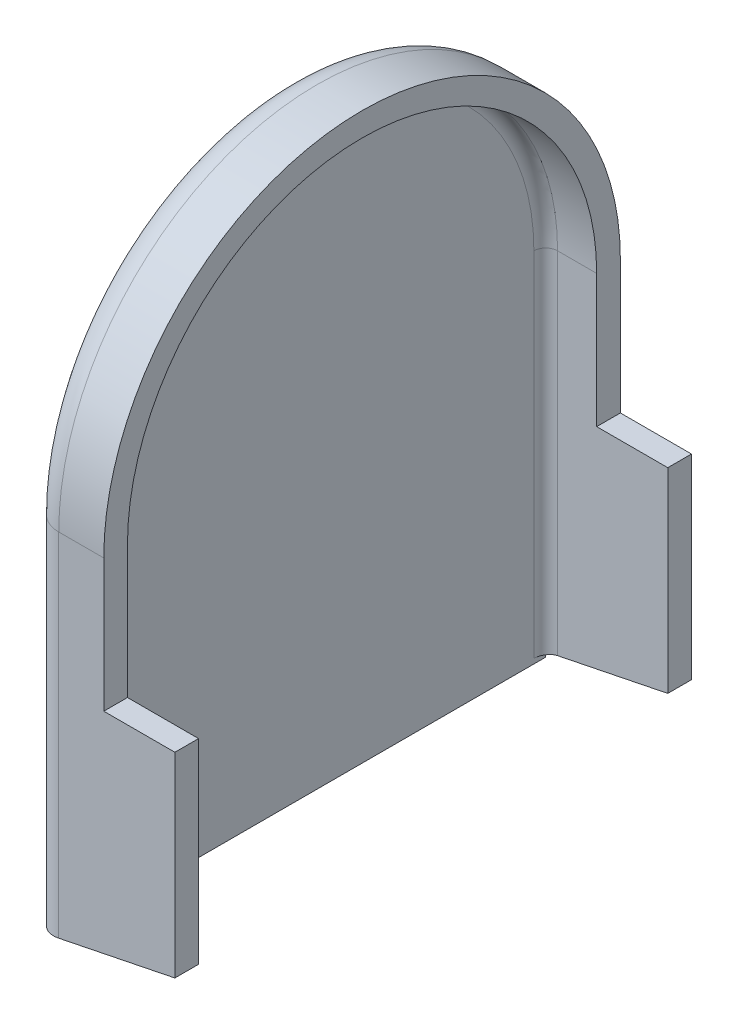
ISO-10303-21;
HEADER;
FILE_DESCRIPTION(('STEP AP214'),'2;1');
FILE_NAME('part.step','',(''),(''),'','','');
FILE_SCHEMA(('AUTOMOTIVE_DESIGN { 1 0 10303 214 1 1 1 1 }'));
ENDSEC;
DATA;
#1=APPLICATION_CONTEXT('core data for automotive mechanical design processes');
#2=APPLICATION_PROTOCOL_DEFINITION('international standard','automotive_design',2000,#1);
#3=PRODUCT_CONTEXT('',#1,'mechanical');
#4=PRODUCT('Part','Part','',(#3));
#5=PRODUCT_RELATED_PRODUCT_CATEGORY('part','',(#4));
#6=PRODUCT_DEFINITION_FORMATION('','',#4);
#7=PRODUCT_DEFINITION_CONTEXT('part definition',#1,'design');
#8=PRODUCT_DEFINITION('design','',#6,#7);
#9=PRODUCT_DEFINITION_SHAPE('','',#8);
#10=(LENGTH_UNIT() NAMED_UNIT(*) SI_UNIT(.MILLI.,.METRE.));
#11=(NAMED_UNIT(*) PLANE_ANGLE_UNIT() SI_UNIT($,.RADIAN.));
#12=(NAMED_UNIT(*) SI_UNIT($,.STERADIAN.) SOLID_ANGLE_UNIT());
#13=UNCERTAINTY_MEASURE_WITH_UNIT(LENGTH_MEASURE(1.E-05),#10,'distance_accuracy_value','');
#14=(GEOMETRIC_REPRESENTATION_CONTEXT(3) GLOBAL_UNCERTAINTY_ASSIGNED_CONTEXT((#13)) GLOBAL_UNIT_ASSIGNED_CONTEXT((#10,
#11,#12)) REPRESENTATION_CONTEXT('',''));
#15=CARTESIAN_POINT('',(0.,0.,0.));
#16=DIRECTION('',(0.,0.,1.));
#17=DIRECTION('',(1.,0.,0.));
#18=AXIS2_PLACEMENT_3D('',#15,#16,#17);
#19=CARTESIAN_POINT('',(-2.,-26.,21.8));
#20=DIRECTION('',(0.,-1.,0.));
#21=DIRECTION('',(0.,0.,-1.));
#22=AXIS2_PLACEMENT_3D('',#19,#20,#21);
#23=PLANE('',#22);
#24=DIRECTION('',(0.,0.,-1.));
#25=VECTOR('',#24,1.);
#26=CARTESIAN_POINT('',(-2.,-26.,21.8));
#27=LINE('',#26,#25);
#28=CARTESIAN_POINT('',(-2.,-26.,19.3));
#29=VERTEX_POINT('',#28);
#30=CARTESIAN_POINT('',(-2.,-26.,-19.3));
#31=VERTEX_POINT('',#30);
#32=EDGE_CURVE('E247',#29,#31,#27,.T.);
#33=ORIENTED_EDGE('',*,*,#32,.T.);
#34=CARTESIAN_POINT('',(0.5,-26.,-19.3));
#35=DIRECTION('',(0.,-1.,0.));
#36=DIRECTION('',(0.,0.,-1.));
#37=AXIS2_PLACEMENT_3D('',#34,#35,#36);
#38=CIRCLE('',#37,2.5);
#39=CARTESIAN_POINT('',(-1.94948974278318,-26.,-19.8));
#40=VERTEX_POINT('',#39);
#41=EDGE_CURVE('E433',#31,#40,#38,.T.);
#42=ORIENTED_EDGE('',*,*,#41,.T.);
#43=DIRECTION('',(1.,0.,0.));
#44=VECTOR('',#43,1.);
#45=CARTESIAN_POINT('',(10.3,-26.,-19.8));
#46=LINE('',#45,#44);
#47=CARTESIAN_POINT('',(0.,-26.,-19.8));
#48=VERTEX_POINT('',#47);
#49=EDGE_CURVE('E254',#40,#48,#46,.T.);
#50=ORIENTED_EDGE('',*,*,#49,.T.);
#51=DIRECTION('',(0.,0.,-1.));
#52=VECTOR('',#51,1.);
#53=CARTESIAN_POINT('',(0.,-26.,21.8));
#54=LINE('',#53,#52);
#55=CARTESIAN_POINT('',(0.,-26.,19.8));
#56=VERTEX_POINT('',#55);
#57=EDGE_CURVE('E304',#56,#48,#54,.T.);
#58=ORIENTED_EDGE('',*,*,#57,.F.);
#59=DIRECTION('',(1.,0.,0.));
#60=VECTOR('',#59,1.);
#61=CARTESIAN_POINT('',(10.3,-26.,19.8));
#62=LINE('',#61,#60);
#63=CARTESIAN_POINT('',(-1.94948974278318,-26.,19.8));
#64=VERTEX_POINT('',#63);
#65=EDGE_CURVE('E257',#64,#56,#62,.T.);
#66=ORIENTED_EDGE('',*,*,#65,.F.);
#67=CARTESIAN_POINT('',(0.5,-26.,19.3));
#68=DIRECTION('',(0.,-1.,0.));
#69=DIRECTION('',(0.,0.,-1.));
#70=AXIS2_PLACEMENT_3D('',#67,#68,#69);
#71=CIRCLE('',#70,2.5);
#72=EDGE_CURVE('E253',#64,#29,#71,.T.);
#73=ORIENTED_EDGE('',*,*,#72,.T.);
#74=EDGE_LOOP('',(#33,#42,#50,#58,#66,#73));
#75=FACE_BOUND('',#74,.T.);
#76=ADVANCED_FACE('F36',(#75),#23,.T.);
#77=CARTESIAN_POINT('',(-2.,-26.,-21.8));
#78=DIRECTION('',(0.,0.,-1.));
#79=DIRECTION('',(-1.,0.,0.));
#80=AXIS2_PLACEMENT_3D('',#77,#78,#79);
#81=PLANE('',#80);
#82=DIRECTION('',(-0.979963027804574,-0.199179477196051,0.));
#83=VECTOR('',#82,1.);
#84=CARTESIAN_POINT('',(-2.,-26.,-21.8));
#85=LINE('',#84,#83);
#86=CARTESIAN_POINT('',(10.3,-23.5,-21.8));
#87=VERTEX_POINT('',#86);
#88=CARTESIAN_POINT('',(0.5,-25.4918699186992,-21.8));
#89=VERTEX_POINT('',#88);
#90=EDGE_CURVE('E178',#87,#89,#85,.T.);
#91=ORIENTED_EDGE('',*,*,#90,.T.);
#92=DIRECTION('',(0.,1.,0.));
#93=VECTOR('',#92,1.);
#94=CARTESIAN_POINT('',(0.5,-26.,-21.8));
#95=LINE('',#94,#93);
#96=CARTESIAN_POINT('',(0.5,4.2,-21.8));
#97=VERTEX_POINT('',#96);
#98=EDGE_CURVE('E243',#89,#97,#95,.T.);
#99=ORIENTED_EDGE('',*,*,#98,.T.);
#100=DIRECTION('',(1.,0.,0.));
#101=VECTOR('',#100,1.);
#102=CARTESIAN_POINT('',(0.,4.2,-21.8));
#103=LINE('',#102,#101);
#104=CARTESIAN_POINT('',(4.3,4.2,-21.8));
#105=VERTEX_POINT('',#104);
#106=EDGE_CURVE('E298',#105,#97,#103,.F.);
#107=ORIENTED_EDGE('',*,*,#106,.F.);
#108=DIRECTION('',(0.,1.,0.));
#109=VECTOR('',#108,1.);
#110=CARTESIAN_POINT('',(4.3,-26.,-21.8));
#111=LINE('',#110,#109);
#112=CARTESIAN_POINT('',(4.3,-7.,-21.8));
#113=VERTEX_POINT('',#112);
#114=EDGE_CURVE('E288',#113,#105,#111,.T.);
#115=ORIENTED_EDGE('',*,*,#114,.F.);
#116=DIRECTION('',(-1.,0.,0.));
#117=VECTOR('',#116,1.);
#118=CARTESIAN_POINT('',(10.3,-7.,-21.8));
#119=LINE('',#118,#117);
#120=CARTESIAN_POINT('',(10.3,-7.,-21.8));
#121=VERTEX_POINT('',#120);
#122=EDGE_CURVE('E202',#121,#113,#119,.T.);
#123=ORIENTED_EDGE('',*,*,#122,.F.);
#124=DIRECTION('',(0.,-1.,0.));
#125=VECTOR('',#124,1.);
#126=CARTESIAN_POINT('',(10.3,-7.,-21.8));
#127=LINE('',#126,#125);
#128=EDGE_CURVE('E204',#121,#87,#127,.T.);
#129=ORIENTED_EDGE('',*,*,#128,.T.);
#130=EDGE_LOOP('',(#91,#99,#107,#115,#123,#129));
#131=FACE_BOUND('',#130,.T.);
#132=ADVANCED_FACE('F276',(#131),#81,.T.);
#133=CARTESIAN_POINT('',(4.3,-26.,-19.8));
#134=DIRECTION('',(0.,0.,-1.));
#135=DIRECTION('',(-1.,0.,0.));
#136=AXIS2_PLACEMENT_3D('',#133,#134,#135);
#137=PLANE('',#136);
#138=DIRECTION('',(-1.,0.,0.));
#139=VECTOR('',#138,1.);
#140=CARTESIAN_POINT('',(4.3,4.2,-19.8));
#141=LINE('',#140,#139);
#142=CARTESIAN_POINT('',(4.3,4.2,-19.8));
#143=VERTEX_POINT('',#142);
#144=CARTESIAN_POINT('',(1.,4.2,-19.8));
#145=VERTEX_POINT('',#144);
#146=EDGE_CURVE('E285',#143,#145,#141,.T.);
#147=ORIENTED_EDGE('',*,*,#146,.T.);
#148=DIRECTION('',(0.,-1.,0.));
#149=VECTOR('',#148,1.);
#150=CARTESIAN_POINT('',(1.,-25.5934959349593,-19.8));
#151=LINE('',#150,#149);
#152=CARTESIAN_POINT('',(1.,-25.390243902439,-19.8));
#153=VERTEX_POINT('',#152);
#154=EDGE_CURVE('E193',#145,#153,#151,.T.);
#155=ORIENTED_EDGE('',*,*,#154,.T.);
#156=DIRECTION('',(-0.979963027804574,-0.199179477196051,0.));
#157=VECTOR('',#156,1.);
#158=CARTESIAN_POINT('',(-2.,-26.,-19.8));
#159=LINE('',#158,#157);
#160=CARTESIAN_POINT('',(10.3,-23.5,-19.8));
#161=VERTEX_POINT('',#160);
#162=EDGE_CURVE('E176',#161,#153,#159,.T.);
#163=ORIENTED_EDGE('',*,*,#162,.F.);
#164=DIRECTION('',(0.,1.,0.));
#165=VECTOR('',#164,1.);
#166=CARTESIAN_POINT('',(10.3,-26.,-19.8));
#167=LINE('',#166,#165);
#168=CARTESIAN_POINT('',(10.3,-7.,-19.8));
#169=VERTEX_POINT('',#168);
#170=EDGE_CURVE('E190',#161,#169,#167,.T.);
#171=ORIENTED_EDGE('',*,*,#170,.T.);
#172=DIRECTION('',(-1.,0.,0.));
#173=VECTOR('',#172,1.);
#174=CARTESIAN_POINT('',(10.3,-7.,-19.8));
#175=LINE('',#174,#173);
#176=CARTESIAN_POINT('',(4.3,-7.,-19.8));
#177=VERTEX_POINT('',#176);
#178=EDGE_CURVE('E200',#169,#177,#175,.T.);
#179=ORIENTED_EDGE('',*,*,#178,.T.);
#180=DIRECTION('',(0.,-1.,0.));
#181=VECTOR('',#180,1.);
#182=CARTESIAN_POINT('',(4.3,-26.,-19.8));
#183=LINE('',#182,#181);
#184=EDGE_CURVE('E283',#143,#177,#183,.T.);
#185=ORIENTED_EDGE('',*,*,#184,.F.);
#186=EDGE_LOOP('',(#147,#155,#163,#171,#179,#185));
#187=FACE_BOUND('',#186,.T.);
#188=ADVANCED_FACE('F188',(#187),#137,.F.);
#189=CARTESIAN_POINT('',(10.3,0.,0.));
#190=DIRECTION('',(1.,0.,0.));
#191=DIRECTION('',(0.,0.,1.));
#192=AXIS2_PLACEMENT_3D('',#189,#190,#191);
#193=PLANE('',#192);
#194=ORIENTED_EDGE('',*,*,#170,.F.);
#195=DIRECTION('',(0.,0.,-1.));
#196=VECTOR('',#195,1.);
#197=CARTESIAN_POINT('',(10.3,-23.5,-19.8));
#198=LINE('',#197,#196);
#199=EDGE_CURVE('E173',#161,#87,#198,.T.);
#200=ORIENTED_EDGE('',*,*,#199,.T.);
#201=ORIENTED_EDGE('',*,*,#128,.F.);
#202=DIRECTION('',(0.,0.,-1.));
#203=VECTOR('',#202,1.);
#204=CARTESIAN_POINT('',(10.3,-7.,-19.8));
#205=LINE('',#204,#203);
#206=EDGE_CURVE('E199',#169,#121,#205,.T.);
#207=ORIENTED_EDGE('',*,*,#206,.F.);
#208=EDGE_LOOP('',(#194,#200,#201,#207));
#209=FACE_BOUND('',#208,.T.);
#210=ADVANCED_FACE('F197',(#209),#193,.T.);
#211=CARTESIAN_POINT('',(0.,0.,0.));
#212=DIRECTION('',(-1.,0.,0.));
#213=DIRECTION('',(0.,0.,1.));
#214=AXIS2_PLACEMENT_3D('',#211,#212,#213);
#215=PLANE('',#214);
#216=DIRECTION('',(0.,-1.,0.));
#217=VECTOR('',#216,1.);
#218=CARTESIAN_POINT('',(0.,0.,-19.8));
#219=LINE('',#218,#217);
#220=CARTESIAN_POINT('',(0.,-25.5934959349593,-19.8));
#221=VERTEX_POINT('',#220);
#222=EDGE_CURVE('E183',#221,#48,#219,.T.);
#223=ORIENTED_EDGE('',*,*,#222,.F.);
#224=DIRECTION('',(0.,0.,1.));
#225=VECTOR('',#224,1.);
#226=CARTESIAN_POINT('',(0.,-25.5934959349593,0.));
#227=LINE('',#226,#225);
#228=CARTESIAN_POINT('',(0.,-25.5934959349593,-18.8));
#229=VERTEX_POINT('',#228);
#230=EDGE_CURVE('E53',#221,#229,#227,.T.);
#231=ORIENTED_EDGE('',*,*,#230,.T.);
#232=DIRECTION('',(0.,-1.,0.));
#233=VECTOR('',#232,1.);
#234=CARTESIAN_POINT('',(0.,4.2,-18.8));
#235=LINE('',#234,#233);
#236=CARTESIAN_POINT('',(0.,4.2,-18.8));
#237=VERTEX_POINT('',#236);
#238=EDGE_CURVE('E353',#229,#237,#235,.F.);
#239=ORIENTED_EDGE('',*,*,#238,.T.);
#240=CARTESIAN_POINT('',(0.,4.2,0.));
#241=DIRECTION('',(-1.,0.,0.));
#242=DIRECTION('',(0.,0.,1.));
#243=AXIS2_PLACEMENT_3D('',#240,#241,#242);
#244=CIRCLE('',#243,18.8);
#245=CARTESIAN_POINT('',(0.,4.2,18.8));
#246=VERTEX_POINT('',#245);
#247=EDGE_CURVE('E379',#237,#246,#244,.F.);
#248=ORIENTED_EDGE('',*,*,#247,.T.);
#249=DIRECTION('',(0.,1.,0.));
#250=VECTOR('',#249,1.);
#251=CARTESIAN_POINT('',(0.,-25.5934959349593,18.8));
#252=LINE('',#251,#250);
#253=CARTESIAN_POINT('',(0.,-25.5934959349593,18.8));
#254=VERTEX_POINT('',#253);
#255=EDGE_CURVE('E376',#246,#254,#252,.F.);
#256=ORIENTED_EDGE('',*,*,#255,.T.);
#257=DIRECTION('',(0.,0.,1.));
#258=VECTOR('',#257,1.);
#259=CARTESIAN_POINT('',(0.,-25.5934959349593,19.8));
#260=LINE('',#259,#258);
#261=CARTESIAN_POINT('',(0.,-25.5934959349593,19.8));
#262=VERTEX_POINT('',#261);
#263=EDGE_CURVE('E374',#254,#262,#260,.T.);
#264=ORIENTED_EDGE('',*,*,#263,.T.);
#265=DIRECTION('',(0.,1.,0.));
#266=VECTOR('',#265,1.);
#267=CARTESIAN_POINT('',(0.,4.2,19.8));
#268=LINE('',#267,#266);
#269=EDGE_CURVE('E240',#56,#262,#268,.T.);
#270=ORIENTED_EDGE('',*,*,#269,.F.);
#271=ORIENTED_EDGE('',*,*,#57,.T.);
#272=EDGE_LOOP('',(#223,#231,#239,#248,#256,#264,#270,#271));
#273=FACE_BOUND('',#272,.T.);
#274=ADVANCED_FACE('F381',(#273),#215,.F.);
#275=CARTESIAN_POINT('',(-2.,0.,0.));
#276=DIRECTION('',(-1.,0.,0.));
#277=DIRECTION('',(0.,0.,1.));
#278=AXIS2_PLACEMENT_3D('',#275,#276,#277);
#279=PLANE('',#278);
#280=CARTESIAN_POINT('',(-2.,4.2,0.));
#281=DIRECTION('',(-1.,0.,0.));
#282=DIRECTION('',(0.,0.,1.));
#283=AXIS2_PLACEMENT_3D('',#280,#281,#282);
#284=CIRCLE('',#283,19.3);
#285=CARTESIAN_POINT('',(-2.,4.2,19.3));
#286=VERTEX_POINT('',#285);
#287=CARTESIAN_POINT('',(-2.,4.2,-19.3));
#288=VERTEX_POINT('',#287);
#289=EDGE_CURVE('E249',#286,#288,#284,.T.);
#290=ORIENTED_EDGE('',*,*,#289,.T.);
#291=DIRECTION('',(0.,1.,0.));
#292=VECTOR('',#291,1.);
#293=CARTESIAN_POINT('',(-2.,0.,-19.3));
#294=LINE('',#293,#292);
#295=EDGE_CURVE('E251',#288,#31,#294,.F.);
#296=ORIENTED_EDGE('',*,*,#295,.T.);
#297=ORIENTED_EDGE('',*,*,#32,.F.);
#298=DIRECTION('',(0.,-1.,0.));
#299=VECTOR('',#298,1.);
#300=CARTESIAN_POINT('',(-2.,0.,19.3));
#301=LINE('',#300,#299);
#302=EDGE_CURVE('E246',#29,#286,#301,.F.);
#303=ORIENTED_EDGE('',*,*,#302,.T.);
#304=EDGE_LOOP('',(#290,#296,#297,#303));
#305=FACE_BOUND('',#304,.T.);
#306=ADVANCED_FACE('F402',(#305),#279,.T.);
#307=CARTESIAN_POINT('',(-2.,-26.,21.8));
#308=DIRECTION('',(0.,0.,1.));
#309=DIRECTION('',(1.,0.,0.));
#310=AXIS2_PLACEMENT_3D('',#307,#308,#309);
#311=PLANE('',#310);
#312=DIRECTION('',(1.,0.,0.));
#313=VECTOR('',#312,1.);
#314=CARTESIAN_POINT('',(0.,4.2,21.8));
#315=LINE('',#314,#313);
#316=CARTESIAN_POINT('',(4.3,4.2,21.8));
#317=VERTEX_POINT('',#316);
#318=CARTESIAN_POINT('',(0.5,4.2,21.8));
#319=VERTEX_POINT('',#318);
#320=EDGE_CURVE('E301',#317,#319,#315,.F.);
#321=ORIENTED_EDGE('',*,*,#320,.T.);
#322=DIRECTION('',(0.,-1.,0.));
#323=VECTOR('',#322,1.);
#324=CARTESIAN_POINT('',(0.5,-26.,21.8));
#325=LINE('',#324,#323);
#326=CARTESIAN_POINT('',(0.5,-25.4918699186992,21.8));
#327=VERTEX_POINT('',#326);
#328=EDGE_CURVE('E422',#319,#327,#325,.T.);
#329=ORIENTED_EDGE('',*,*,#328,.T.);
#330=DIRECTION('',(-0.979963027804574,-0.199179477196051,0.));
#331=VECTOR('',#330,1.);
#332=CARTESIAN_POINT('',(-2.,-26.,21.8));
#333=LINE('',#332,#331);
#334=CARTESIAN_POINT('',(10.3,-23.5,21.8));
#335=VERTEX_POINT('',#334);
#336=EDGE_CURVE('E266',#335,#327,#333,.T.);
#337=ORIENTED_EDGE('',*,*,#336,.F.);
#338=DIRECTION('',(0.,-1.,0.));
#339=VECTOR('',#338,1.);
#340=CARTESIAN_POINT('',(10.3,-7.,21.8));
#341=LINE('',#340,#339);
#342=CARTESIAN_POINT('',(10.3,-7.,21.8));
#343=VERTEX_POINT('',#342);
#344=EDGE_CURVE('E214',#343,#335,#341,.T.);
#345=ORIENTED_EDGE('',*,*,#344,.F.);
#346=DIRECTION('',(-1.,0.,0.));
#347=VECTOR('',#346,1.);
#348=CARTESIAN_POINT('',(10.3,-7.,21.8));
#349=LINE('',#348,#347);
#350=CARTESIAN_POINT('',(4.3,-7.,21.8));
#351=VERTEX_POINT('',#350);
#352=EDGE_CURVE('E221',#343,#351,#349,.T.);
#353=ORIENTED_EDGE('',*,*,#352,.T.);
#354=DIRECTION('',(0.,-1.,0.));
#355=VECTOR('',#354,1.);
#356=CARTESIAN_POINT('',(4.3,4.2,21.8));
#357=LINE('',#356,#355);
#358=EDGE_CURVE('E314',#317,#351,#357,.T.);
#359=ORIENTED_EDGE('',*,*,#358,.F.);
#360=EDGE_LOOP('',(#321,#329,#337,#345,#353,#359));
#361=FACE_BOUND('',#360,.T.);
#362=ADVANCED_FACE('F328',(#361),#311,.T.);
#363=CARTESIAN_POINT('',(0.,4.2,0.));
#364=DIRECTION('',(1.,0.,0.));
#365=DIRECTION('',(0.,0.,-1.));
#366=AXIS2_PLACEMENT_3D('',#363,#364,#365);
#367=CYLINDRICAL_SURFACE('',#366,21.8);
#368=ORIENTED_EDGE('',*,*,#106,.T.);
#369=CARTESIAN_POINT('',(0.5,4.2,0.));
#370=DIRECTION('',(-1.,0.,0.));
#371=DIRECTION('',(0.,0.,1.));
#372=AXIS2_PLACEMENT_3D('',#369,#370,#371);
#373=CIRCLE('',#372,21.8);
#374=EDGE_CURVE('E325',#97,#319,#373,.F.);
#375=ORIENTED_EDGE('',*,*,#374,.T.);
#376=ORIENTED_EDGE('',*,*,#320,.F.);
#377=CARTESIAN_POINT('',(4.3,4.2,0.));
#378=DIRECTION('',(1.,0.,0.));
#379=DIRECTION('',(0.,0.,-1.));
#380=AXIS2_PLACEMENT_3D('',#377,#378,#379);
#381=CIRCLE('',#380,21.8);
#382=EDGE_CURVE('E224',#105,#317,#381,.T.);
#383=ORIENTED_EDGE('',*,*,#382,.F.);
#384=EDGE_LOOP('',(#368,#375,#376,#383));
#385=FACE_BOUND('',#384,.T.);
#386=ADVANCED_FACE('F323',(#385),#367,.T.);
#387=CARTESIAN_POINT('',(4.3,4.2,19.8));
#388=DIRECTION('',(0.,0.,1.));
#389=DIRECTION('',(0.,-1.,0.));
#390=AXIS2_PLACEMENT_3D('',#387,#388,#389);
#391=PLANE('',#390);
#392=DIRECTION('',(-0.979963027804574,-0.199179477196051,0.));
#393=VECTOR('',#392,1.);
#394=CARTESIAN_POINT('',(-2.,-26.,19.8));
#395=LINE('',#394,#393);
#396=CARTESIAN_POINT('',(10.3,-23.5,19.8));
#397=VERTEX_POINT('',#396);
#398=CARTESIAN_POINT('',(1.,-25.390243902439,19.8));
#399=VERTEX_POINT('',#398);
#400=EDGE_CURVE('E270',#397,#399,#395,.T.);
#401=ORIENTED_EDGE('',*,*,#400,.T.);
#402=DIRECTION('',(0.,1.,0.));
#403=VECTOR('',#402,1.);
#404=CARTESIAN_POINT('',(1.,4.2,19.8));
#405=LINE('',#404,#403);
#406=CARTESIAN_POINT('',(1.,4.2,19.8));
#407=VERTEX_POINT('',#406);
#408=EDGE_CURVE('E343',#399,#407,#405,.T.);
#409=ORIENTED_EDGE('',*,*,#408,.T.);
#410=DIRECTION('',(-1.,0.,0.));
#411=VECTOR('',#410,1.);
#412=CARTESIAN_POINT('',(4.3,4.2,19.8));
#413=LINE('',#412,#411);
#414=CARTESIAN_POINT('',(4.3,4.2,19.8));
#415=VERTEX_POINT('',#414);
#416=EDGE_CURVE('E295',#415,#407,#413,.T.);
#417=ORIENTED_EDGE('',*,*,#416,.F.);
#418=DIRECTION('',(0.,1.,0.));
#419=VECTOR('',#418,1.);
#420=CARTESIAN_POINT('',(4.3,4.2,19.8));
#421=LINE('',#420,#419);
#422=CARTESIAN_POINT('',(4.3,-6.99999999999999,19.8));
#423=VERTEX_POINT('',#422);
#424=EDGE_CURVE('E230',#423,#415,#421,.T.);
#425=ORIENTED_EDGE('',*,*,#424,.F.);
#426=DIRECTION('',(-1.,0.,0.));
#427=VECTOR('',#426,1.);
#428=CARTESIAN_POINT('',(10.3,-7.,19.8));
#429=LINE('',#428,#427);
#430=CARTESIAN_POINT('',(10.3,-7.,19.8));
#431=VERTEX_POINT('',#430);
#432=EDGE_CURVE('E235',#431,#423,#429,.T.);
#433=ORIENTED_EDGE('',*,*,#432,.F.);
#434=DIRECTION('',(0.,1.,0.));
#435=VECTOR('',#434,1.);
#436=CARTESIAN_POINT('',(10.3,-26.,19.8));
#437=LINE('',#436,#435);
#438=EDGE_CURVE('E217',#397,#431,#437,.T.);
#439=ORIENTED_EDGE('',*,*,#438,.F.);
#440=EDGE_LOOP('',(#401,#409,#417,#425,#433,#439));
#441=FACE_BOUND('',#440,.T.);
#442=ADVANCED_FACE('F339',(#441),#391,.F.);
#443=CARTESIAN_POINT('',(4.3,4.2,0.));
#444=DIRECTION('',(-1.,0.,0.));
#445=DIRECTION('',(0.,0.,1.));
#446=AXIS2_PLACEMENT_3D('',#443,#444,#445);
#447=CYLINDRICAL_SURFACE('',#446,19.8);
#448=ORIENTED_EDGE('',*,*,#416,.T.);
#449=CARTESIAN_POINT('',(1.,4.2,0.));
#450=DIRECTION('',(-1.,0.,0.));
#451=DIRECTION('',(0.,0.,1.));
#452=AXIS2_PLACEMENT_3D('',#449,#450,#451);
#453=CIRCLE('',#452,19.8);
#454=EDGE_CURVE('E348',#407,#145,#453,.T.);
#455=ORIENTED_EDGE('',*,*,#454,.T.);
#456=ORIENTED_EDGE('',*,*,#146,.F.);
#457=CARTESIAN_POINT('',(4.3,4.2,0.));
#458=DIRECTION('',(-1.,0.,0.));
#459=DIRECTION('',(0.,0.,-1.));
#460=AXIS2_PLACEMENT_3D('',#457,#458,#459);
#461=CIRCLE('',#460,19.8);
#462=EDGE_CURVE('E289',#415,#143,#461,.T.);
#463=ORIENTED_EDGE('',*,*,#462,.F.);
#464=EDGE_LOOP('',(#448,#455,#456,#463));
#465=FACE_BOUND('',#464,.T.);
#466=ADVANCED_FACE('F346',(#465),#447,.F.);
#467=CARTESIAN_POINT('',(4.3,4.2,0.));
#468=DIRECTION('',(1.,0.,0.));
#469=DIRECTION('',(0.,0.,-1.));
#470=AXIS2_PLACEMENT_3D('',#467,#468,#469);
#471=PLANE('',#470);
#472=DIRECTION('',(0.,0.,-1.));
#473=VECTOR('',#472,1.);
#474=CARTESIAN_POINT('',(4.3,-7.,-19.8));
#475=LINE('',#474,#473);
#476=EDGE_CURVE('E208',#177,#113,#475,.T.);
#477=ORIENTED_EDGE('',*,*,#476,.T.);
#478=ORIENTED_EDGE('',*,*,#114,.T.);
#479=ORIENTED_EDGE('',*,*,#382,.T.);
#480=ORIENTED_EDGE('',*,*,#358,.T.);
#481=DIRECTION('',(0.,0.,1.));
#482=VECTOR('',#481,1.);
#483=CARTESIAN_POINT('',(4.3,-7.,19.8));
#484=LINE('',#483,#482);
#485=EDGE_CURVE('E213',#423,#351,#484,.T.);
#486=ORIENTED_EDGE('',*,*,#485,.F.);
#487=ORIENTED_EDGE('',*,*,#424,.T.);
#488=ORIENTED_EDGE('',*,*,#462,.T.);
#489=ORIENTED_EDGE('',*,*,#184,.T.);
#490=EDGE_LOOP('',(#477,#478,#479,#480,#486,#487,#488,#489));
#491=FACE_BOUND('',#490,.T.);
#492=ADVANCED_FACE('F320',(#491),#471,.T.);
#493=CARTESIAN_POINT('',(10.3,-7.,19.8));
#494=DIRECTION('',(0.,-1.,0.));
#495=DIRECTION('',(0.,0.,-1.));
#496=AXIS2_PLACEMENT_3D('',#493,#494,#495);
#497=PLANE('',#496);
#498=ORIENTED_EDGE('',*,*,#485,.T.);
#499=ORIENTED_EDGE('',*,*,#352,.F.);
#500=DIRECTION('',(0.,0.,1.));
#501=VECTOR('',#500,1.);
#502=CARTESIAN_POINT('',(10.3,-7.,19.8));
#503=LINE('',#502,#501);
#504=EDGE_CURVE('E219',#431,#343,#503,.T.);
#505=ORIENTED_EDGE('',*,*,#504,.F.);
#506=ORIENTED_EDGE('',*,*,#432,.T.);
#507=EDGE_LOOP('',(#498,#499,#505,#506));
#508=FACE_BOUND('',#507,.T.);
#509=ADVANCED_FACE('F334',(#508),#497,.F.);
#510=CARTESIAN_POINT('',(10.3,0.,0.));
#511=DIRECTION('',(1.,0.,0.));
#512=DIRECTION('',(0.,0.,-1.));
#513=AXIS2_PLACEMENT_3D('',#510,#511,#512);
#514=PLANE('',#513);
#515=DIRECTION('',(0.,0.,1.));
#516=VECTOR('',#515,1.);
#517=CARTESIAN_POINT('',(10.3,-23.5,19.8));
#518=LINE('',#517,#516);
#519=EDGE_CURVE('E209',#397,#335,#518,.T.);
#520=ORIENTED_EDGE('',*,*,#519,.F.);
#521=ORIENTED_EDGE('',*,*,#438,.T.);
#522=ORIENTED_EDGE('',*,*,#504,.T.);
#523=ORIENTED_EDGE('',*,*,#344,.T.);
#524=EDGE_LOOP('',(#520,#521,#522,#523));
#525=FACE_BOUND('',#524,.T.);
#526=ADVANCED_FACE('F606',(#525),#514,.T.);
#527=CARTESIAN_POINT('',(10.3,-7.,-19.8));
#528=DIRECTION('',(0.,1.,0.));
#529=DIRECTION('',(0.,0.,1.));
#530=AXIS2_PLACEMENT_3D('',#527,#528,#529);
#531=PLANE('',#530);
#532=ORIENTED_EDGE('',*,*,#476,.F.);
#533=ORIENTED_EDGE('',*,*,#178,.F.);
#534=ORIENTED_EDGE('',*,*,#206,.T.);
#535=ORIENTED_EDGE('',*,*,#122,.T.);
#536=EDGE_LOOP('',(#532,#533,#534,#535));
#537=FACE_BOUND('',#536,.T.);
#538=ADVANCED_FACE('F281',(#537),#531,.T.);
#539=CARTESIAN_POINT('',(0.,0.,19.8));
#540=DIRECTION('',(0.,0.,1.));
#541=DIRECTION('',(1.,0.,0.));
#542=AXIS2_PLACEMENT_3D('',#539,#540,#541);
#543=PLANE('',#542);
#544=CARTESIAN_POINT('',(-1.94948974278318,-25.9897336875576,19.8));
#545=VERTEX_POINT('',#544);
#546=EDGE_CURVE('E272',#262,#545,#395,.T.);
#547=ORIENTED_EDGE('',*,*,#546,.T.);
#548=DIRECTION('',(0.,-1.,0.));
#549=VECTOR('',#548,1.);
#550=CARTESIAN_POINT('',(-1.94948974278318,-25.9897336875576,19.8));
#551=LINE('',#550,#549);
#552=EDGE_CURVE('E370',#545,#64,#551,.T.);
#553=ORIENTED_EDGE('',*,*,#552,.T.);
#554=ORIENTED_EDGE('',*,*,#65,.T.);
#555=ORIENTED_EDGE('',*,*,#269,.T.);
#556=EDGE_LOOP('',(#547,#553,#554,#555));
#557=FACE_BOUND('',#556,.T.);
#558=ADVANCED_FACE('F448',(#557),#543,.T.);
#559=CARTESIAN_POINT('',(-2.,-26.,19.8));
#560=DIRECTION('',(-0.199179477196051,0.979963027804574,0.));
#561=DIRECTION('',(-0.979963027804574,-0.199179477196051,0.));
#562=AXIS2_PLACEMENT_3D('',#559,#560,#561);
#563=PLANE('',#562);
#564=ORIENTED_EDGE('',*,*,#336,.T.);
#565=CARTESIAN_POINT('',(0.5,-25.4918699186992,19.3));
#566=DIRECTION('',(-0.199179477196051,0.979963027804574,0.));
#567=DIRECTION('',(-0.979963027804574,-0.199179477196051,0.));
#568=AXIS2_PLACEMENT_3D('',#565,#566,#567);
#569=ELLIPSE('',#568,2.55111665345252,2.5);
#570=EDGE_CURVE('E420',#327,#545,#569,.F.);
#571=ORIENTED_EDGE('',*,*,#570,.T.);
#572=ORIENTED_EDGE('',*,*,#546,.F.);
#573=ORIENTED_EDGE('',*,*,#263,.F.);
#574=CARTESIAN_POINT('',(1.,-25.390243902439,18.8));
#575=DIRECTION('',(-0.199179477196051,0.979963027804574,0.));
#576=DIRECTION('',(-0.979963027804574,-0.199179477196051,0.));
#577=AXIS2_PLACEMENT_3D('',#574,#575,#576);
#578=ELLIPSE('',#577,1.02044666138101,1.);
#579=EDGE_CURVE('E11',#254,#399,#578,.T.);
#580=ORIENTED_EDGE('',*,*,#579,.T.);
#581=ORIENTED_EDGE('',*,*,#400,.F.);
#582=ORIENTED_EDGE('',*,*,#519,.T.);
#583=EDGE_LOOP('',(#564,#571,#572,#573,#580,#581,#582));
#584=FACE_BOUND('',#583,.T.);
#585=ADVANCED_FACE('F449',(#584),#563,.F.);
#586=CARTESIAN_POINT('',(0.,0.,-19.8));
#587=DIRECTION('',(0.,0.,-1.));
#588=DIRECTION('',(1.,0.,0.));
#589=AXIS2_PLACEMENT_3D('',#586,#587,#588);
#590=PLANE('',#589);
#591=ORIENTED_EDGE('',*,*,#49,.F.);
#592=DIRECTION('',(0.,1.,0.));
#593=VECTOR('',#592,1.);
#594=CARTESIAN_POINT('',(-1.94948974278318,-26.,-19.8));
#595=LINE('',#594,#593);
#596=CARTESIAN_POINT('',(-1.94948974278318,-25.9897336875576,-19.8));
#597=VERTEX_POINT('',#596);
#598=EDGE_CURVE('E431',#40,#597,#595,.T.);
#599=ORIENTED_EDGE('',*,*,#598,.T.);
#600=EDGE_CURVE('E194',#221,#597,#159,.T.);
#601=ORIENTED_EDGE('',*,*,#600,.F.);
#602=ORIENTED_EDGE('',*,*,#222,.T.);
#603=EDGE_LOOP('',(#591,#599,#601,#602));
#604=FACE_BOUND('',#603,.T.);
#605=ADVANCED_FACE('F416',(#604),#590,.T.);
#606=CARTESIAN_POINT('',(-2.,-26.,-19.8));
#607=DIRECTION('',(0.199179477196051,-0.979963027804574,0.));
#608=DIRECTION('',(0.979963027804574,0.199179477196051,0.));
#609=AXIS2_PLACEMENT_3D('',#606,#607,#608);
#610=PLANE('',#609);
#611=ORIENTED_EDGE('',*,*,#600,.T.);
#612=CARTESIAN_POINT('',(0.5,-25.4918699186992,-19.3));
#613=DIRECTION('',(0.199179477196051,-0.979963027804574,0.));
#614=DIRECTION('',(0.979963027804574,0.199179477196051,0.));
#615=AXIS2_PLACEMENT_3D('',#612,#613,#614);
#616=ELLIPSE('',#615,2.55111665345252,2.5);
#617=EDGE_CURVE('E429',#597,#89,#616,.T.);
#618=ORIENTED_EDGE('',*,*,#617,.T.);
#619=ORIENTED_EDGE('',*,*,#90,.F.);
#620=ORIENTED_EDGE('',*,*,#199,.F.);
#621=ORIENTED_EDGE('',*,*,#162,.T.);
#622=CARTESIAN_POINT('',(1.,-25.390243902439,-18.8));
#623=DIRECTION('',(0.199179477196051,-0.979963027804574,0.));
#624=DIRECTION('',(0.979963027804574,0.199179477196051,0.));
#625=AXIS2_PLACEMENT_3D('',#622,#623,#624);
#626=ELLIPSE('',#625,1.02044666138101,1.);
#627=EDGE_CURVE('E45',#153,#229,#626,.F.);
#628=ORIENTED_EDGE('',*,*,#627,.T.);
#629=ORIENTED_EDGE('',*,*,#230,.F.);
#630=EDGE_LOOP('',(#611,#618,#619,#620,#621,#628,#629));
#631=FACE_BOUND('',#630,.T.);
#632=ADVANCED_FACE('F175',(#631),#610,.T.);
#633=CARTESIAN_POINT('',(0.5,-26.,19.3));
#634=DIRECTION('',(0.,-1.,0.));
#635=DIRECTION('',(0.,0.,-1.));
#636=AXIS2_PLACEMENT_3D('',#633,#634,#635);
#637=CYLINDRICAL_SURFACE('',#636,2.5);
#638=ORIENTED_EDGE('',*,*,#570,.F.);
#639=ORIENTED_EDGE('',*,*,#328,.F.);
#640=CARTESIAN_POINT('',(0.5,4.2,19.3));
#641=DIRECTION('',(0.,1.,0.));
#642=DIRECTION('',(0.,0.,1.));
#643=AXIS2_PLACEMENT_3D('',#640,#641,#642);
#644=CIRCLE('',#643,2.5);
#645=EDGE_CURVE('E262',#286,#319,#644,.T.);
#646=ORIENTED_EDGE('',*,*,#645,.F.);
#647=ORIENTED_EDGE('',*,*,#302,.F.);
#648=ORIENTED_EDGE('',*,*,#72,.F.);
#649=ORIENTED_EDGE('',*,*,#552,.F.);
#650=EDGE_LOOP('',(#638,#639,#646,#647,#648,#649));
#651=FACE_BOUND('',#650,.T.);
#652=ADVANCED_FACE('F409',(#651),#637,.T.);
#653=CARTESIAN_POINT('',(0.5,4.2,0.));
#654=DIRECTION('',(-1.,0.,0.));
#655=DIRECTION('',(0.,0.,1.));
#656=AXIS2_PLACEMENT_3D('',#653,#654,#655);
#657=TOROIDAL_SURFACE('',#656,19.3,2.5);
#658=ORIENTED_EDGE('',*,*,#645,.T.);
#659=ORIENTED_EDGE('',*,*,#374,.F.);
#660=CARTESIAN_POINT('',(0.5,4.2,-19.3));
#661=DIRECTION('',(0.,-1.,0.));
#662=DIRECTION('',(0.,0.,-1.));
#663=AXIS2_PLACEMENT_3D('',#660,#661,#662);
#664=CIRCLE('',#663,2.5);
#665=EDGE_CURVE('E361',#288,#97,#664,.T.);
#666=ORIENTED_EDGE('',*,*,#665,.F.);
#667=ORIENTED_EDGE('',*,*,#289,.F.);
#668=EDGE_LOOP('',(#658,#659,#666,#667));
#669=FACE_BOUND('',#668,.T.);
#670=ADVANCED_FACE('F407',(#669),#657,.T.);
#671=CARTESIAN_POINT('',(0.5,-26.,-19.3));
#672=DIRECTION('',(0.,1.,0.));
#673=DIRECTION('',(0.,0.,1.));
#674=AXIS2_PLACEMENT_3D('',#671,#672,#673);
#675=CYLINDRICAL_SURFACE('',#674,2.5);
#676=ORIENTED_EDGE('',*,*,#41,.F.);
#677=ORIENTED_EDGE('',*,*,#295,.F.);
#678=ORIENTED_EDGE('',*,*,#665,.T.);
#679=ORIENTED_EDGE('',*,*,#98,.F.);
#680=ORIENTED_EDGE('',*,*,#617,.F.);
#681=ORIENTED_EDGE('',*,*,#598,.F.);
#682=EDGE_LOOP('',(#676,#677,#678,#679,#680,#681));
#683=FACE_BOUND('',#682,.T.);
#684=ADVANCED_FACE('F404',(#683),#675,.T.);
#685=CARTESIAN_POINT('',(1.,4.2,18.8));
#686=DIRECTION('',(0.,-1.,0.));
#687=DIRECTION('',(0.,0.,-1.));
#688=AXIS2_PLACEMENT_3D('',#685,#686,#687);
#689=CYLINDRICAL_SURFACE('',#688,1.);
#690=ORIENTED_EDGE('',*,*,#579,.F.);
#691=ORIENTED_EDGE('',*,*,#255,.F.);
#692=CARTESIAN_POINT('',(1.,4.2,18.8));
#693=DIRECTION('',(0.,-1.,0.));
#694=DIRECTION('',(0.,0.,-1.));
#695=AXIS2_PLACEMENT_3D('',#692,#693,#694);
#696=CIRCLE('',#695,1.);
#697=EDGE_CURVE('E40',#407,#246,#696,.T.);
#698=ORIENTED_EDGE('',*,*,#697,.F.);
#699=ORIENTED_EDGE('',*,*,#408,.F.);
#700=EDGE_LOOP('',(#690,#691,#698,#699));
#701=FACE_BOUND('',#700,.T.);
#702=ADVANCED_FACE('F38',(#701),#689,.F.);
#703=CARTESIAN_POINT('',(1.,4.2,0.));
#704=DIRECTION('',(-1.,0.,0.));
#705=DIRECTION('',(0.,0.,1.));
#706=AXIS2_PLACEMENT_3D('',#703,#704,#705);
#707=TOROIDAL_SURFACE('',#706,18.8,1.);
#708=ORIENTED_EDGE('',*,*,#697,.T.);
#709=ORIENTED_EDGE('',*,*,#247,.F.);
#710=CARTESIAN_POINT('',(1.,4.2,-18.8));
#711=DIRECTION('',(0.,1.,0.));
#712=DIRECTION('',(0.,0.,1.));
#713=AXIS2_PLACEMENT_3D('',#710,#711,#712);
#714=CIRCLE('',#713,1.);
#715=EDGE_CURVE('E357',#145,#237,#714,.T.);
#716=ORIENTED_EDGE('',*,*,#715,.F.);
#717=ORIENTED_EDGE('',*,*,#454,.F.);
#718=EDGE_LOOP('',(#708,#709,#716,#717));
#719=FACE_BOUND('',#718,.T.);
#720=ADVANCED_FACE('F383',(#719),#707,.F.);
#721=CARTESIAN_POINT('',(1.,-26.,-18.8));
#722=DIRECTION('',(0.,1.,0.));
#723=DIRECTION('',(0.,0.,1.));
#724=AXIS2_PLACEMENT_3D('',#721,#722,#723);
#725=CYLINDRICAL_SURFACE('',#724,1.);
#726=ORIENTED_EDGE('',*,*,#715,.T.);
#727=ORIENTED_EDGE('',*,*,#238,.F.);
#728=ORIENTED_EDGE('',*,*,#627,.F.);
#729=ORIENTED_EDGE('',*,*,#154,.F.);
#730=EDGE_LOOP('',(#726,#727,#728,#729));
#731=FACE_BOUND('',#730,.T.);
#732=ADVANCED_FACE('F384',(#731),#725,.F.);
#733=CLOSED_SHELL('',(#76,#132,#188,#210,#274,#306,#362,#386,#442,#466,#492,#509,#526,#538,#558,
#585,#605,#632,#652,#670,#684,#702,#720,#732));
#734=MANIFOLD_SOLID_BREP('B2',#733);
#735=ADVANCED_BREP_SHAPE_REPRESENTATION('',(#18,#734),#14);
#736=SHAPE_DEFINITION_REPRESENTATION(#9,#735);
ENDSEC;
END-ISO-10303-21;
